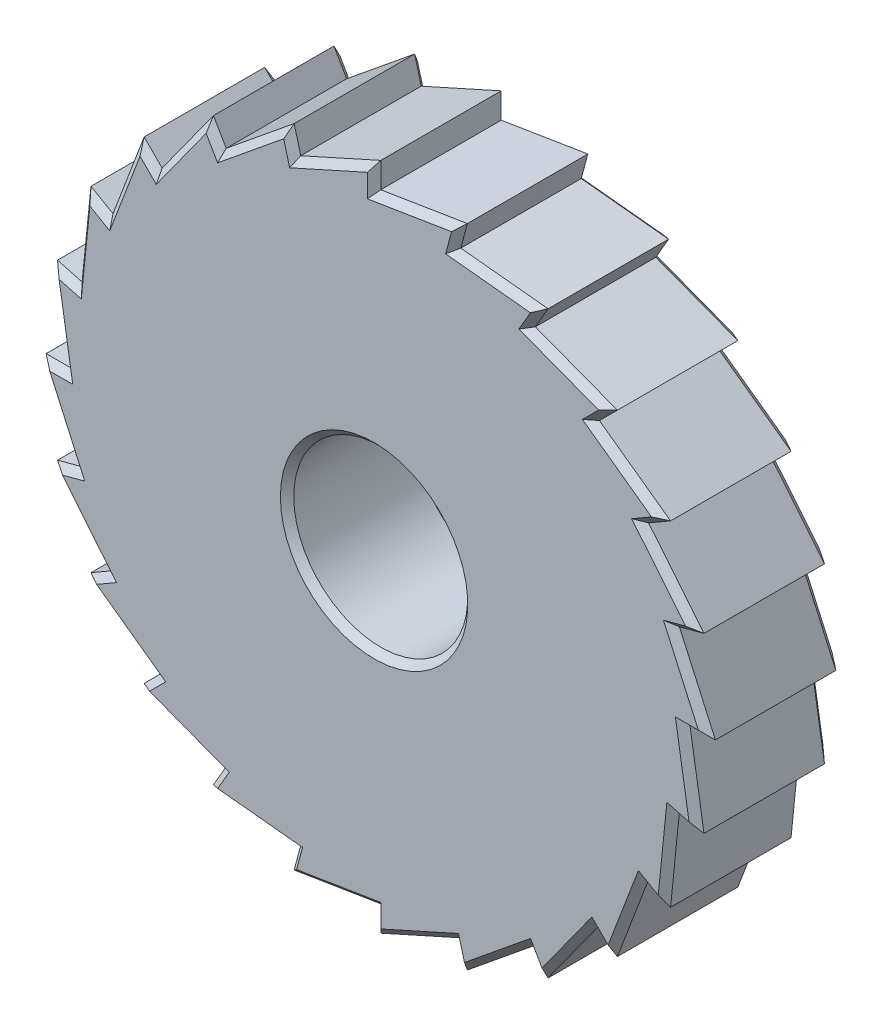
from build123d import *

# Parameters (mm, degrees)
SKETCH_1_R      = 6.5
EXTRUDE_1_DEPTH = 10
CHAMFER_1_SIZE  = 0.5


with BuildPart() as part:
    # Sketch 1 → Extrude 1 (new body)
    with BuildSketch(Plane.XY):
        Polygon((6.470476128, 24.148145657), (5.978719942, 22.312886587), (12.5, 21.650635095), (11.55, 20.005186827), (17.67766953, 17.67766953), (16.334166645, 16.334166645), (21.650635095, 12.5), (20.005186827, 11.55), (24.148145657, 6.470476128), (22.312886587, 5.978719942), (25, 0), (23.1, 0), (24.148145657, -6.470476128), (22.312886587, -5.978719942), (21.650635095, -12.5), (20.005186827, -11.55), (17.67766953, -17.67766953), (16.334166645, -16.334166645), (12.5, -21.650635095), (11.55, -20.005186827), (6.470476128, -24.148145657), (5.978719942, -22.312886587), (0, -25), (0, -23.1), (-6.470476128, -24.148145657), (-5.978719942, -22.312886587), (-12.5, -21.650635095), (-11.55, -20.005186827), (-17.67766953, -17.67766953), (-16.334166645, -16.334166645), (-21.650635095, -12.5), (-20.005186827, -11.55), (-24.148145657, -6.470476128), (-22.312886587, -5.978719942), (-25, 0), (-23.1, 0), (-24.148145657, 6.470476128), (-22.312886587, 5.978719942), (-21.650635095, 12.5), (-20.005186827, 11.55), (-17.67766953, 17.67766953), (-16.334166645, 16.334166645), (-12.5, 21.650635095), (-11.55, 20.005186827), (-6.470476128, 24.148145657), (-5.978719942, 22.312886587), (0, 25), (0, 23.1), align=None)
        Circle(SKETCH_1_R, mode=Mode.SUBTRACT)
    extrude(amount=EXTRUDE_1_DEPTH)

    # Chamfer 1
    chamfer_1_edges = [part.edges().sort_by_distance(p)[0] for p in [
        (23.624072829, -3.235238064, 10),
        (-14.417083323, 18.99240087, 10),
        (-12.025, 20.827910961, 10),
        (-9.010238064, 22.076666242, 10),
        (-6.5, 0, 0),
        (-6.224598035, 23.230516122, 10),
        (-6.5, 0, 10),
        (-2.989359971, 23.656443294, 10),
        (0, 24.05, 10),
        (3.235238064, 23.624072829, 10),
        (6.224598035, 23.230516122, 10),
        (9.239359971, 21.981760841, 10),
        (12.025, 20.827910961, 10),
        (23.230516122, -6.224598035, 10),
        (14.613834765, 18.841428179, 10),
        (17.005918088, 17.005918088, 10),
        (18.99240087, 14.417083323, 10),
        (20.827910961, 12.025, 10),
        (22.076666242, 9.010238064, 10),
        (23.230516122, 6.224598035, 10),
        (21.981760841, -9.239359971, 10),
        (20.827910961, -12.025, 10),
        (18.841428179, -14.613834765, 10),
        (17.005918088, -17.005918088, 10),
        (14.417083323, -18.99240087, 10),
        (12.025, -20.827910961, 10),
        (9.010238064, -22.076666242, 10),
        (6.224598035, -23.230516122, 10),
        (23.230516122, 6.224598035, 0),
        (23.656443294, 2.989359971, 10),
        (2.989359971, -23.656443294, 10),
        (22.076666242, 9.010238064, 0),
        (20.827910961, 12.025, 0),
        (18.99240087, 14.417083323, 0),
        (17.005918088, 17.005918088, 0),
        (14.613834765, 18.841428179, 0),
        (12.025, 20.827910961, 0),
        (9.239359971, 21.981760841, 0),
        (6.224598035, 23.230516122, 0),
        (0, -24.05, 10),
        (3.235238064, 23.624072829, 0),
        (0, 24.05, 0),
        (-2.989359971, 23.656443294, 0),
        (-6.224598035, 23.230516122, 0),
        (-9.010238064, 22.076666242, 0),
        (-12.025, 20.827910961, 0),
        (-14.417083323, 18.99240087, 0),
        (-3.235238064, -23.624072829, 10),
        (-17.005918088, 17.005918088, 0),
        (-18.841428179, 14.613834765, 0),
        (-20.827910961, 12.025, 0),
        (-21.981760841, 9.239359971, 0),
        (-23.230516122, 6.224598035, 0),
        (-23.624072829, 3.235238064, 0),
        (-24.05, 0, 0),
        (-23.656443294, -2.989359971, 0),
        (-6.224598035, -23.230516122, 10),
        (-23.230516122, -6.224598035, 0),
        (-22.076666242, -9.010238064, 0),
        (-20.827910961, -12.025, 0),
        (-18.99240087, -14.417083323, 0),
        (-17.005918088, -17.005918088, 0),
        (-14.613834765, -18.841428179, 0),
        (-12.025, -20.827910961, 0),
        (-9.239359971, -21.981760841, 10),
        (-9.239359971, -21.981760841, 0),
        (-6.224598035, -23.230516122, 0),
        (-3.235238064, -23.624072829, 0),
        (0, -24.05, 0),
        (2.989359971, -23.656443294, 0),
        (6.224598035, -23.230516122, 0),
        (9.010238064, -22.076666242, 0),
        (12.025, -20.827910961, 0),
        (-12.025, -20.827910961, 10),
        (14.417083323, -18.99240087, 0),
        (17.005918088, -17.005918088, 0),
        (18.841428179, -14.613834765, 0),
        (20.827910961, -12.025, 0),
        (21.981760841, -9.239359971, 0),
        (23.230516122, -6.224598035, 0),
        (23.624072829, -3.235238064, 0),
        (-14.613834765, -18.841428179, 10),
        (24.05, 0, 0),
        (23.656443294, 2.989359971, 0),
        (-17.005918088, -17.005918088, 10),
        (-18.99240087, -14.417083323, 10),
        (-20.827910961, -12.025, 10),
        (24.05, 0, 10),
        (-22.076666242, -9.010238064, 10),
        (-23.230516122, -6.224598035, 10),
        (-23.656443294, -2.989359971, 10),
        (-24.05, 0, 10),
        (-23.624072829, 3.235238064, 10),
        (-23.230516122, 6.224598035, 10),
        (-21.981760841, 9.239359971, 10),
        (-20.827910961, 12.025, 10),
        (-18.841428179, 14.613834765, 10),
        (-17.005918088, 17.005918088, 10),
    ]]
    chamfer(chamfer_1_edges, length=CHAMFER_1_SIZE)


solid = part.part
